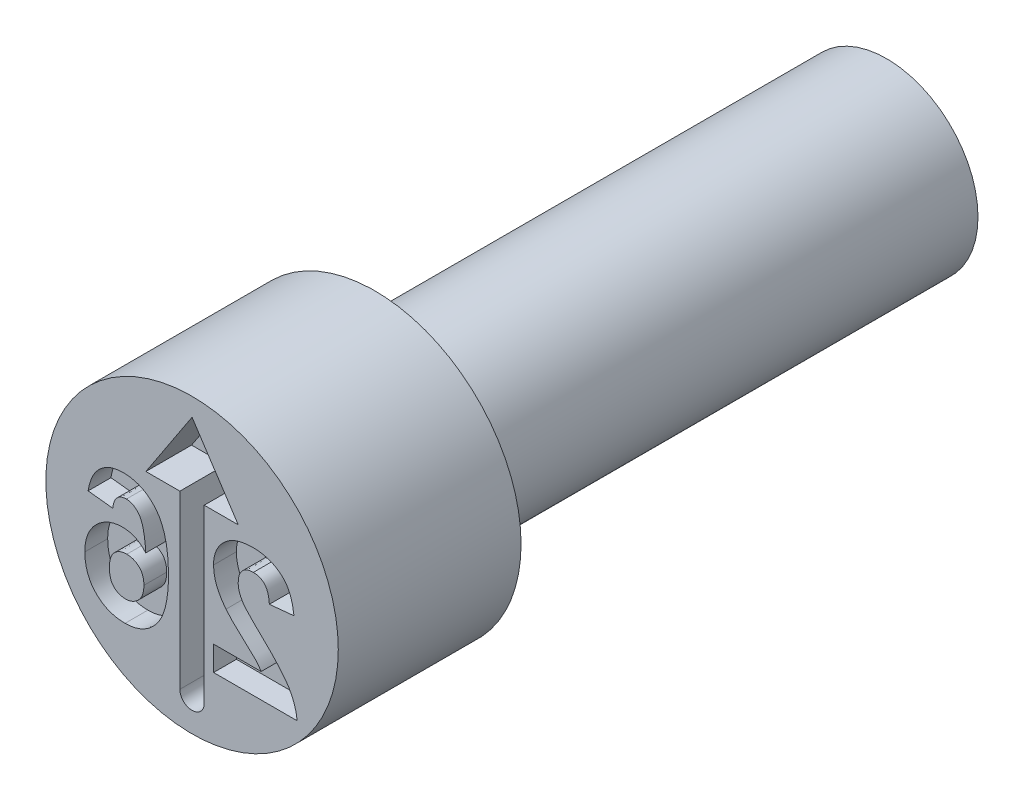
from build123d import *

# Parameters (mm, degrees)
CUT_EXTRUDE4_DEPTH = 0.25
CUT_EXTRUDE5_DEPTH = 0.125


with BuildPart() as part:
    # Sketch2 → Revolve1 (revolve)
    with BuildSketch(Plane(origin=(0, 0, 0), x_dir=(0, 0, -1), z_dir=(1, 0, 0)), mode=Mode.PRIVATE) as revolve1_sk:
        Polygon((0, 0.8), (0, 0), (3.8, 0), (3.8, 0.5), (1, 0.5), (1, 0.8), align=None)
    revolve(revolve1_sk.sketch.rotate(Axis((0, 0, -0.403888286), (0, 0, -1)), 90), axis=Axis((0, 0, -0.403888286), (0, 0, -1)))

    # Sketch3 → Cut-Extrude4 (cut)
    with BuildSketch(Plane.XY):
        with BuildLine():
            Line((0.066665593, 0.317223), (0.066665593, -0.621656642))
            ThreePointArc((0.066665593, -0.621656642), (0, -0.688322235), (-0.066665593, -0.621656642))
            Line((-0.066665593, -0.621656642), (-0.066665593, 0.317223))
            Line((-0.066665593, 0.317223), (-0.252671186, 0.317223))
            Line((-0.252671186, 0.317223), (0, 0.700740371))
            Line((0, 0.700740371), (0.252671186, 0.317223))
            Line((0.252671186, 0.317223), (0.066665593, 0.317223))
        make_face()
    extrude(amount=-CUT_EXTRUDE4_DEPTH, mode=Mode.SUBTRACT)

    # Sketch4 → Cut-Extrude5 (cut)
    # profile 1 of 2: a face of its own
    with BuildSketch(Plane.XY):
        with BuildLine():
            Line((0.117670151, -0.315384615), (0.117670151, -0.45))
            Line((0.117670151, -0.45), (0.575362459, -0.45))
            add(Edge.make_bspline(
                [(0.575362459, -0.45), (0.573812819, -0.438495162), (0.570714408, -0.415491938), (0.561135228, -0.381890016), (0.548350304, -0.349100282), (0.534474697, -0.322417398), (0.520673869, -0.300938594), (0.508152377, -0.283338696), (0.493214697, -0.26461316), (0.476077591, -0.244610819), (0.456835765, -0.223269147), (0.435345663, -0.200667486), (0.411504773, -0.176914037), (0.394732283, -0.160784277), (0.386059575, -0.15244391)],
                knots=[0, 0, 0, 0, 1.156289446, 2.311930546, 3.473459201, 4.661751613, 5.303057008, 6.018253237, 6.81459331, 7.690699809, 8.644447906, 9.679642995, 10.800191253, 12, 12, 12, 12], degree=3))
            add(Edge.make_bspline(
                [(0.386059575, -0.15244391), (0.379138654, -0.145763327), (0.365963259, -0.133045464), (0.347201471, -0.114834), (0.330707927, -0.098092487), (0.316137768, -0.083254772), (0.303827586, -0.069943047), (0.293615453, -0.058366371), (0.285372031, -0.048477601), (0.280907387, -0.042204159), (0.278928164, -0.039423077)],
                knots=[0, 0, 0, 0, 1.480720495, 2.818855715, 4.024636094, 5.098235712, 6.019786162, 6.815086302, 7.474715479, 8, 8, 8, 8], degree=3))
            add(Edge.make_bspline(
                [(0.278928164, -0.039423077), (0.274875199, -0.032690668), (0.267057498, -0.019704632), (0.25848474, 0.000716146), (0.253339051, 0.021132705), (0.252632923, 0.034774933), (0.252285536, 0.041486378)],
                knots=[0, 0, 0, 0, 1.0911822, 2.104764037, 3.067617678, 4, 4, 4, 4], degree=3))
            add(Edge.make_bspline(
                [(0.252285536, 0.041486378), (0.252537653, 0.048470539), (0.253014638, 0.061684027), (0.25701424, 0.080330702), (0.264106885, 0.096360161), (0.273872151, 0.109821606), (0.286220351, 0.120368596), (0.300655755, 0.128161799), (0.317389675, 0.132470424), (0.329151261, 0.133037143), (0.335298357, 0.133333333)],
                knots=[0, 0, 0, 0, 1.193122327, 2.257294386, 3.237245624, 4.168877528, 5.075331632, 5.990371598, 6.949684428, 8, 8, 8, 8], degree=3))
            add(Edge.make_bspline(
                [(0.335298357, 0.133333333), (0.341403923, 0.133056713), (0.353198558, 0.132522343), (0.369961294, 0.127854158), (0.384625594, 0.119773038), (0.395076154, 0.110563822), (0.402136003, 0.101608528), (0.406946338, 0.09380458), (0.411092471, 0.084936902), (0.414766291, 0.075105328), (0.417668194, 0.064197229), (0.420005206, 0.05229568), (0.421888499, 0.039336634), (0.42248742, 0.030321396), (0.422798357, 0.025641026)],
                knots=[0, 0, 0, 0, 1.402788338, 2.709884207, 3.961032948, 5.225417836, 5.883680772, 6.578928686, 7.329201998, 8.132101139, 8.990263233, 9.922304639, 10.921339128, 12, 12, 12, 12], degree=3))
            Line((0.422798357, 0.025641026), (0.557413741, 0.038822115))
            add(Edge.make_bspline(
                [(0.557413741, 0.038822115), (0.556331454, 0.047910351), (0.554233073, 0.065530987), (0.548996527, 0.090840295), (0.542364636, 0.114189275), (0.534021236, 0.135534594), (0.524311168, 0.155011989), (0.512739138, 0.172329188), (0.499709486, 0.187678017), (0.485210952, 0.201050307), (0.469335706, 0.2124886), (0.452677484, 0.222699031), (0.434910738, 0.23107483), (0.41623108, 0.237977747), (0.396646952, 0.243494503), (0.376067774, 0.247142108), (0.354620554, 0.249707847), (0.339980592, 0.249901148), (0.332493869, 0.25)],
                knots=[0, 0, 0, 0, 1.270971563, 2.464210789, 3.586263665, 4.638946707, 5.643716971, 6.603612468, 7.52484387, 8.434700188, 9.336036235, 10.239171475, 11.145359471, 12.059630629, 13.003312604, 13.96741569, 14.960557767, 16, 16, 16, 16], degree=3))
            add(Edge.make_bspline(
                [(0.332493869, 0.25), (0.324354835, 0.249843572), (0.308503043, 0.249538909), (0.285362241, 0.247022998), (0.26362312, 0.242636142), (0.243095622, 0.236825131), (0.223990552, 0.229067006), (0.20614871, 0.219687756), (0.189850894, 0.208331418), (0.174854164, 0.195617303), (0.161448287, 0.181635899), (0.149705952, 0.166722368), (0.139868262, 0.1508871), (0.131612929, 0.134323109), (0.125483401, 0.116763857), (0.121017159, 0.09845214), (0.118055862, 0.079302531), (0.117800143, 0.066223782), (0.117670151, 0.059575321)],
                knots=[0, 0, 0, 0, 1.210756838, 2.35810096, 3.457354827, 4.507168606, 5.527358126, 6.519769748, 7.499700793, 8.476517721, 9.440526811, 10.376769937, 11.295256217, 12.209626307, 13.124630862, 14.055668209, 15.011616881, 16, 16, 16, 16], degree=3))
            add(Edge.make_bspline(
                [(0.117670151, 0.059575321), (0.117841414, 0.051944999), (0.118181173, 0.036807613), (0.121434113, 0.014430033), (0.126403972, -0.007431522), (0.133749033, -0.028830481), (0.143059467, -0.050280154), (0.15506084, -0.071828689), (0.168995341, -0.094125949), (0.179905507, -0.108542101), (0.185538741, -0.115985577)],
                knots=[0, 0, 0, 0, 0.953409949, 1.89141903, 2.821310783, 3.752688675, 4.715703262, 5.740811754, 6.833515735, 8, 8, 8, 8], degree=3))
            add(Edge.make_bspline(
                [(0.185538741, -0.115985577), (0.187667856, -0.118667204), (0.192227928, -0.124410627), (0.199985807, -0.133217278), (0.208976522, -0.142836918), (0.219073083, -0.153449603), (0.230608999, -0.164679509), (0.243169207, -0.176996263), (0.257306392, -0.189769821), (0.27194909, -0.203318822), (0.286655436, -0.216505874), (0.300172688, -0.22903065), (0.31245085, -0.240112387), (0.322918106, -0.250362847), (0.332190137, -0.259082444), (0.339932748, -0.266718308), (0.346290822, -0.273085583), (0.355051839, -0.283010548), (0.366199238, -0.296434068), (0.37404189, -0.309260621), (0.377786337, -0.315384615)],
                knots=[0, 0, 0, 0, 0.665555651, 1.425465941, 2.280616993, 3.225313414, 4.272635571, 5.410053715, 6.644756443, 7.976022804, 9.288331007, 10.484517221, 11.558462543, 12.503158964, 13.33222979, 14.032602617, 14.617328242, 15.080653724, 16.606167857, 18, 18, 18, 18], degree=3))
            Line((0.377786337, -0.315384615), (0.117670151, -0.315384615))
        make_face()
    # profile 2 of 2: a face of its own
    with BuildSketch(Plane.XY):
        with BuildLine():
            Line((-0.568688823, 0.06728766), (-0.434073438, 0.052564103))
            add(Edge.make_bspline(
                [(-0.434073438, 0.052564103), (-0.433171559, 0.059047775), (-0.431474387, 0.071248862), (-0.426447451, 0.088086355), (-0.419449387, 0.102250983), (-0.410466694, 0.113762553), (-0.399767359, 0.122622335), (-0.387576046, 0.12891775), (-0.373900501, 0.132654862), (-0.364312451, 0.133101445), (-0.359333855, 0.133333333)],
                knots=[0, 0, 0, 0, 1.280716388, 2.410074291, 3.425374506, 4.35753932, 5.248331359, 6.12451615, 7.026154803, 8, 8, 8, 8], degree=3))
            add(Edge.make_bspline(
                [(-0.359333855, 0.133333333), (-0.355957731, 0.13325078), (-0.349239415, 0.133086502), (-0.339453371, 0.131000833), (-0.330018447, 0.127905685), (-0.321011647, 0.123522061), (-0.312388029, 0.117865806), (-0.304278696, 0.110869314), (-0.296310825, 0.102901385), (-0.288953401, 0.093279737), (-0.281894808, 0.081887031), (-0.275817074, 0.06794021), (-0.270399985, 0.051452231), (-0.265761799, 0.032342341), (-0.261552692, 0.010731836), (-0.258102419, -0.013466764), (-0.255341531, -0.040275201), (-0.254017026, -0.05904999), (-0.25332424, -0.068870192)],
                knots=[0, 0, 0, 0, 0.642458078, 1.278459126, 1.898279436, 2.531842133, 3.181731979, 3.858193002, 4.57010051, 5.325711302, 6.161524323, 7.118599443, 8.217371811, 9.466325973, 10.864147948, 12.412648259, 14.123626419, 16, 16, 16, 16], degree=3))
            add(Edge.make_bspline(
                [(-0.25332424, -0.068870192), (-0.257626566, -0.064197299), (-0.266062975, -0.055034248), (-0.280061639, -0.043087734), (-0.294727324, -0.032874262), (-0.310219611, -0.024495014), (-0.326623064, -0.018259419), (-0.343640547, -0.013524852), (-0.361494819, -0.01087278), (-0.373628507, -0.010464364), (-0.379806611, -0.01025641)],
                knots=[0, 0, 0, 0, 1.057745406, 2.074127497, 3.059409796, 4.031705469, 5.000875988, 5.977809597, 6.970362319, 8, 8, 8, 8], degree=3))
            add(Edge.make_bspline(
                [(-0.379806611, -0.01025641), (-0.386779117, -0.010457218), (-0.400547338, -0.010853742), (-0.420831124, -0.013634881), (-0.44029475, -0.018635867), (-0.459026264, -0.025400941), (-0.477118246, -0.033919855), (-0.494224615, -0.044703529), (-0.510613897, -0.057276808), (-0.526060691, -0.071641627), (-0.54025258, -0.087456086), (-0.552782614, -0.104536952), (-0.56309442, -0.122936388), (-0.571909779, -0.142242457), (-0.578468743, -0.162836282), (-0.583229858, -0.184421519), (-0.586071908, -0.207196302), (-0.58644603, -0.22273496), (-0.586637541, -0.230689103)],
                knots=[0, 0, 0, 0, 0.99135015, 1.957564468, 2.903754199, 3.843479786, 4.78583385, 5.741106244, 6.712813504, 7.719198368, 8.735844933, 9.730198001, 10.724351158, 11.729813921, 12.742848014, 13.790983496, 14.86921809, 16, 16, 16, 16], degree=3))
            add(Edge.make_bspline(
                [(-0.586637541, -0.230689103), (-0.586443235, -0.239109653), (-0.586064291, -0.255531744), (-0.583275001, -0.279582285), (-0.57834793, -0.302283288), (-0.571616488, -0.323816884), (-0.562909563, -0.344012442), (-0.552361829, -0.363036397), (-0.539616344, -0.380563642), (-0.525251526, -0.396829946), (-0.509237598, -0.411345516), (-0.492171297, -0.424199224), (-0.473863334, -0.434884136), (-0.454584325, -0.44387732), (-0.434003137, -0.450477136), (-0.412482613, -0.455426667), (-0.389847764, -0.458445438), (-0.374393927, -0.458795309), (-0.366485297, -0.458974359)],
                knots=[0, 0, 0, 0, 1.13287417, 2.209376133, 3.25169942, 4.254157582, 5.240146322, 6.205890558, 7.174579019, 8.150183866, 9.1206468, 10.07783463, 11.019441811, 11.967766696, 12.934309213, 13.921380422, 14.936249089, 16, 16, 16, 16], degree=3))
            add(Edge.make_bspline(
                [(-0.366485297, -0.458974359), (-0.358011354, -0.458737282), (-0.341350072, -0.458271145), (-0.316959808, -0.454435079), (-0.293771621, -0.447945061), (-0.271788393, -0.438881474), (-0.250827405, -0.427480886), (-0.231083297, -0.413319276), (-0.212608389, -0.396531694), (-0.195158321, -0.377345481), (-0.179279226, -0.35518389), (-0.165756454, -0.329569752), (-0.154287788, -0.300783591), (-0.144950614, -0.268751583), (-0.13774299, -0.233476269), (-0.132713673, -0.194954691), (-0.129373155, -0.153250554), (-0.129091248, -0.124359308), (-0.128945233, -0.109395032)],
                knots=[0, 0, 0, 0, 0.852151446, 1.675481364, 2.476404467, 3.269281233, 4.062617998, 4.871616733, 5.707301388, 6.56955125, 7.476395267, 8.442009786, 9.475854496, 10.58877921, 11.794095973, 13.094195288, 14.494932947, 16, 16, 16, 16], degree=3))
            add(Edge.make_bspline(
                [(-0.128945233, -0.109395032), (-0.129154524, -0.094057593), (-0.129558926, -0.064421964), (-0.132813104, -0.021632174), (-0.13798208, 0.017882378), (-0.145511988, 0.054032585), (-0.155143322, 0.086893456), (-0.166819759, 0.116531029), (-0.180834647, 0.142838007), (-0.197129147, 0.165728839), (-0.215057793, 0.185626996), (-0.234322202, 0.202802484), (-0.25484883, 0.217421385), (-0.276637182, 0.229446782), (-0.299866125, 0.238563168), (-0.324315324, 0.245146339), (-0.350025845, 0.249377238), (-0.367637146, 0.249790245), (-0.376581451, 0.25)],
                knots=[0, 0, 0, 0, 1.491699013, 2.882321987, 4.171520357, 5.365488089, 6.470299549, 7.49861535, 8.458736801, 9.361983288, 10.224742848, 11.058789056, 11.867429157, 12.671146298, 13.473202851, 14.288259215, 15.130652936, 16, 16, 16, 16], degree=3))
            add(Edge.make_bspline(
                [(-0.376581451, 0.25), (-0.382899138, 0.249886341), (-0.395249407, 0.249664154), (-0.413350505, 0.247304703), (-0.430618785, 0.243696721), (-0.447099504, 0.238702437), (-0.462676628, 0.232014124), (-0.477412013, 0.22386621), (-0.491355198, 0.214280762), (-0.504433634, 0.203319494), (-0.516542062, 0.190949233), (-0.527475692, 0.177141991), (-0.537306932, 0.162064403), (-0.546078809, 0.145728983), (-0.553436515, 0.127979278), (-0.559761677, 0.108954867), (-0.564963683, 0.08861488), (-0.567428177, 0.074505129), (-0.568688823, 0.06728766)],
                knots=[0, 0, 0, 0, 1.036027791, 2.025301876, 2.989435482, 3.928225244, 4.845595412, 5.765526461, 6.686607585, 7.61747015, 8.561102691, 9.521661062, 10.50224679, 11.510949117, 12.559251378, 13.650572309, 14.798212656, 16, 16, 16, 16], degree=3))
        make_face()
        with BuildLine():
            add(Edge.make_bspline(
                [(-0.263560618, -0.227604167), (-0.263611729, -0.232050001), (-0.263711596, -0.240736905), (-0.265349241, -0.253342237), (-0.267703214, -0.26515951), (-0.270873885, -0.276254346), (-0.275268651, -0.286458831), (-0.280482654, -0.295977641), (-0.286650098, -0.304724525), (-0.296113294, -0.314987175), (-0.309189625, -0.325766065), (-0.326350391, -0.33536463), (-0.34473769, -0.341331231), (-0.357420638, -0.341980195), (-0.363821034, -0.342307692)],
                knots=[0, 0, 0, 0, 0.93816693, 1.833124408, 2.679057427, 3.481731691, 4.264557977, 5.020023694, 5.770442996, 6.518065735, 7.962605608, 9.32780964, 10.651490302, 12, 12, 12, 12], degree=3))
            add(Edge.make_bspline(
                [(-0.363821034, -0.342307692), (-0.369884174, -0.342035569), (-0.381685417, -0.341505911), (-0.39853787, -0.33666523), (-0.413845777, -0.329030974), (-0.42506766, -0.320068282), (-0.432892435, -0.311350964), (-0.438150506, -0.303706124), (-0.442430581, -0.294985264), (-0.44592976, -0.285332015), (-0.448748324, -0.274783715), (-0.450672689, -0.263234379), (-0.451764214, -0.250715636), (-0.451934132, -0.242049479), (-0.452022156, -0.237560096)],
                knots=[0, 0, 0, 0, 1.399678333, 2.724321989, 4.020062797, 5.33532049, 6.016755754, 6.724441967, 7.473839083, 8.257094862, 9.096253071, 9.995581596, 10.961638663, 12, 12, 12, 12], degree=3))
            add(Edge.make_bspline(
                [(-0.452022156, -0.237560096), (-0.451947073, -0.232929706), (-0.451801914, -0.223977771), (-0.450531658, -0.211039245), (-0.448453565, -0.1990781), (-0.445548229, -0.188009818), (-0.441615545, -0.177982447), (-0.436975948, -0.168793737), (-0.431343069, -0.160692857), (-0.42297168, -0.15116518), (-0.410799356, -0.141564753), (-0.394534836, -0.13282029), (-0.376304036, -0.127862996), (-0.363616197, -0.127242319), (-0.357090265, -0.126923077)],
                knots=[0, 0, 0, 0, 1.008384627, 1.949510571, 2.828269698, 3.650667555, 4.437180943, 5.170285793, 5.887596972, 6.580056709, 7.926803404, 9.238379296, 10.579573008, 12, 12, 12, 12], degree=3))
            add(Edge.make_bspline(
                [(-0.357090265, -0.126923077), (-0.350745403, -0.127181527), (-0.338422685, -0.127683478), (-0.320713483, -0.132724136), (-0.304509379, -0.140744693), (-0.292574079, -0.150167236), (-0.28416186, -0.159047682), (-0.278652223, -0.166608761), (-0.273856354, -0.174840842), (-0.270068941, -0.183956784), (-0.267148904, -0.193785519), (-0.265054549, -0.204394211), (-0.263787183, -0.215747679), (-0.263637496, -0.223581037), (-0.263560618, -0.227604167)],
                knots=[0, 0, 0, 0, 1.469034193, 2.853094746, 4.235454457, 5.641396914, 6.354997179, 7.06867986, 7.807229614, 8.560602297, 9.353235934, 10.182779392, 11.06669468, 12, 12, 12, 12], degree=3))
        make_face(mode=Mode.SUBTRACT)
    extrude(amount=-CUT_EXTRUDE5_DEPTH, mode=Mode.SUBTRACT)


solid = part.part
